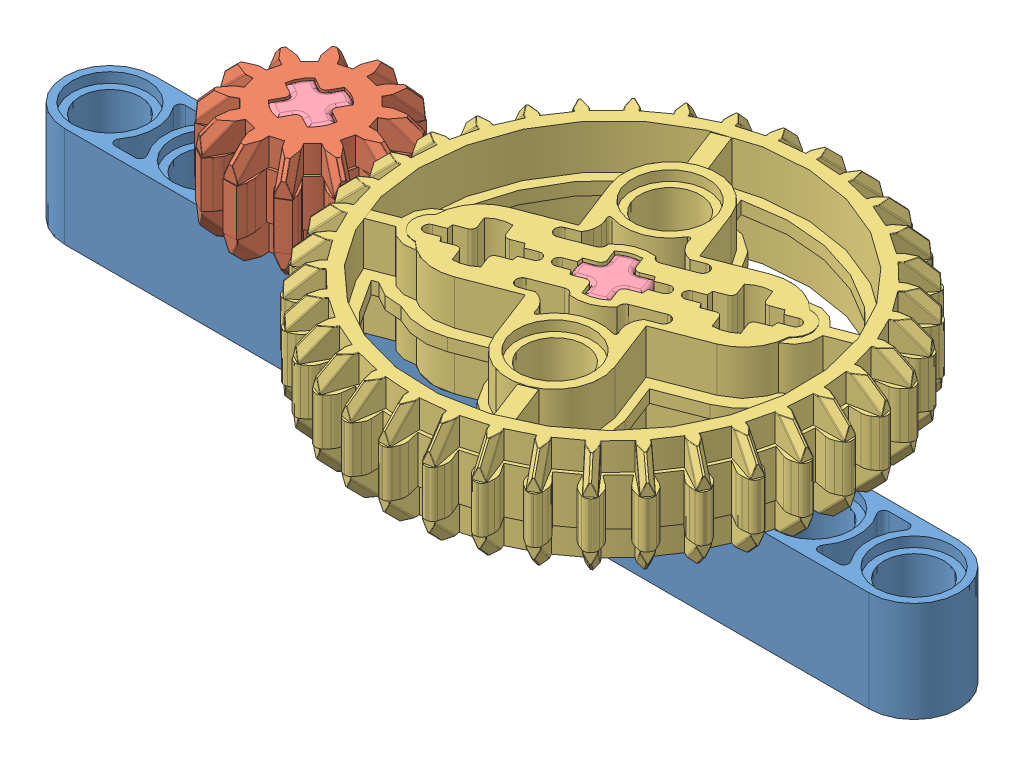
SolidWorks assembly 20.1.SLDASM, configuration Default (file format 12000). Lengths in mm.
Overall size (71.2 16.09 48.44).
5 component instances, 4 part files, 11 mates.
Components (placement in the parent):
- 40490 Beam 9 Red-1: 40490 Beam 9 Red.SLDPRT [Default] at (-5.4231 34.9031 53.4652) size (71.2 8 7.2)
- 32270 Gear 12 Tooth Double Bevel-1: 32270 Gear 12 Tooth Double Bevel.SLDPRT [Default] at (10.5769 46.9031 53.4652) x (-0.877119 0 -0.480274) z (0.480274 0 -0.877119) size (13.27 8.11 13.27)
- 32498 Gear 36 double bevel-1: 32498 Gear 36 double bevel.SLDPRT [Default] at (34.5769 46.9356 53.4652) x (0.360405 0 0.932796) z (-0.932796 0 0.360405) size (37.46 8.13 37.46)
- 3749 Axle Pin without Friction Ridges Lengthwise-1: 3749 Axle Pin without Friction Ridges Lengthwise.SLDPRT [Default] at (34.5769 42.9031 53.4652) x (-0.360405 0 -0.932796) z (0.932796 0 -0.360405) size (6 16 6)
- 3749 Axle Pin without Friction Ridges Lengthwise-2: 3749 Axle Pin without Friction Ridges Lengthwise.SLDPRT [Default] at (10.5769 42.9031 53.4652) x (0.877119 0 0.480274) z (-0.480274 0 0.877119) size (6 16 6)
Mates (geometry in assembly coordinates):
- Concentric2: concentric anti-aligned: cylinder of 40490 Beam 9 Red-1 through (10.5769 42.9031 53.4652) axis (0 -1 0) radius 2.4; cylinder of 3749 Axle Pin without Friction Ridges Lengthwise-2 through (10.5769 34.9031 53.4652) axis (0 1 0) radius 2.4
- Coincident1: coincident aligned: plane of 40490 Beam 9 Red-1 through (10.5769 42.1031 53.4652) normal (0 1 0); circle of 3749 Axle Pin without Friction Ridges Lengthwise-2
- Concentric3: concentric anti-aligned: cylinder of 40490 Beam 9 Red-1 through (34.5769 42.9031 53.4652) axis (0 -1 0) radius 2.4; cylinder of 3749 Axle Pin without Friction Ridges Lengthwise-1 through (34.5769 34.9031 53.4652) axis (0 1 0) radius 2.4
- Coincident2: coincident anti-aligned: plane of 40490 Beam 9 Red-1 through (34.5769 42.1031 53.4652) normal (0 1 0); plane of 3749 Axle Pin without Friction Ridges Lengthwise-1 through (34.5769 42.1031 53.4652) normal (0 -1 0)
- Concentric4: concentric anti-aligned: cylinder of 32270 Gear 12 Tooth Double Bevel-1 through (10.5769 42.8456 53.4652) axis (0 1 0) radius 2.4; cylinder of 3749 Axle Pin without Friction Ridges Lengthwise-2 through (10.5769 50.9031 53.4652) axis (0 -1 0) radius 2.4
- Coincident3: coincident anti-aligned: plane of 32270 Gear 12 Tooth Double Bevel-1 through (12.1127 42.8456 55.3095) normal (0.480274 0 -0.877119); plane of 3749 Axle Pin without Friction Ridges Lengthwise-2 through (11.2769 50.9031 54.8519) normal (-0.480274 0 0.877119)
- Coincident4: coincident anti-aligned: plane of 40490 Beam 9 Red-1 through (-5.4231 42.9031 53.4652) normal (0 1 0); plane of 32270 Gear 12 Tooth Double Bevel-1 through (10.5769 42.9031 53.4652) normal (0 -1 0)
- Concentric5: concentric anti-aligned: cylinder of 32498 Gear 36 double bevel-1 through (34.5769 34.0491 53.4652) axis (0 1 0) radius 2.4; cylinder of 3749 Axle Pin without Friction Ridges Lengthwise-1 through (34.5769 50.9031 53.4652) axis (0 -1 0) radius 2.4
- Coincident5: coincident anti-aligned: plane of 32498 Gear 36 double bevel-1 through (34.593 34.0491 51.0653) normal (-0.932796 0 0.360405); plane of 3749 Axle Pin without Friction Ridges Lengthwise-1 through (34.9364 50.9031 51.9541) normal (0.932796 0 -0.360405)
- Coincident6: coincident anti-aligned: plane of 40490 Beam 9 Red-1 through (-5.4231 42.9031 53.4652) normal (0 1 0); plane of 32498 Gear 36 double bevel-1 through (17.9572 42.9031 46.735) normal (0 -1 0)
- GearMate1: gear = 30.2458 mm: circle of 32270 Gear 12 Tooth Double Bevel-1; circle of 32498 Gear 36 double bevel-1
